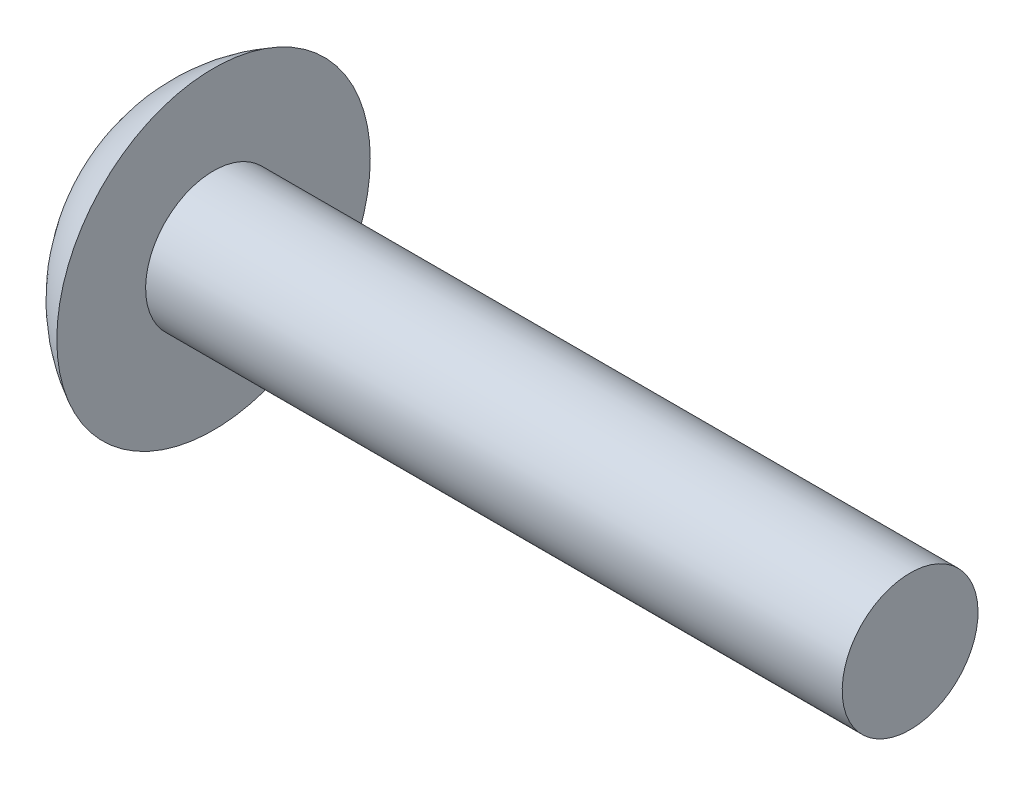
ISO-10303-21;
HEADER;
FILE_DESCRIPTION(('STEP AP214'),'2;1');
FILE_NAME('part.step','',(''),(''),'','','');
FILE_SCHEMA(('AUTOMOTIVE_DESIGN { 1 0 10303 214 1 1 1 1 }'));
ENDSEC;
DATA;
#1=APPLICATION_CONTEXT('core data for automotive mechanical design processes');
#2=APPLICATION_PROTOCOL_DEFINITION('international standard','automotive_design',2000,#1);
#3=PRODUCT_CONTEXT('',#1,'mechanical');
#4=PRODUCT('Part','Part','',(#3));
#5=PRODUCT_RELATED_PRODUCT_CATEGORY('part','',(#4));
#6=PRODUCT_DEFINITION_FORMATION('','',#4);
#7=PRODUCT_DEFINITION_CONTEXT('part definition',#1,'design');
#8=PRODUCT_DEFINITION('design','',#6,#7);
#9=PRODUCT_DEFINITION_SHAPE('','',#8);
#10=(LENGTH_UNIT() NAMED_UNIT(*) SI_UNIT(.MILLI.,.METRE.));
#11=(NAMED_UNIT(*) PLANE_ANGLE_UNIT() SI_UNIT($,.RADIAN.));
#12=(NAMED_UNIT(*) SI_UNIT($,.STERADIAN.) SOLID_ANGLE_UNIT());
#13=UNCERTAINTY_MEASURE_WITH_UNIT(LENGTH_MEASURE(1.E-05),#10,'distance_accuracy_value','');
#14=(GEOMETRIC_REPRESENTATION_CONTEXT(3) GLOBAL_UNCERTAINTY_ASSIGNED_CONTEXT((#13)) GLOBAL_UNIT_ASSIGNED_CONTEXT((#10,
#11,#12)) REPRESENTATION_CONTEXT('',''));
#15=CARTESIAN_POINT('',(0.,0.,0.));
#16=DIRECTION('',(0.,0.,1.));
#17=DIRECTION('',(1.,0.,0.));
#18=AXIS2_PLACEMENT_3D('',#15,#16,#17);
#19=CARTESIAN_POINT('',(7.,-2.5,2.97496745));
#20=DIRECTION('',(1.,0.,0.));
#21=DIRECTION('',(0.,0.,-1.));
#22=AXIS2_PLACEMENT_3D('',#19,#20,#21);
#23=PLANE('',#22);
#24=DIRECTION('',(0.,0.,1.));
#25=VECTOR('',#24,1.);
#26=CARTESIAN_POINT('',(7.,2.5,-0.0991115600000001));
#27=LINE('',#26,#25);
#28=CARTESIAN_POINT('',(7.,2.5,-1.545084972));
#29=VERTEX_POINT('',#28);
#30=CARTESIAN_POINT('',(7.,2.5,1.346861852));
#31=VERTEX_POINT('',#30);
#32=EDGE_CURVE('E128',#29,#31,#27,.T.);
#33=ORIENTED_EDGE('',*,*,#32,.F.);
#34=DIRECTION('',(0.,0.894427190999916,0.447213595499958));
#35=VECTOR('',#34,1.);
#36=CARTESIAN_POINT('',(7.,1.206682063,-2.1917439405));
#37=LINE('',#36,#35);
#38=CARTESIAN_POINT('',(7.,-0.086635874,-2.838402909));
#39=VERTEX_POINT('',#38);
#40=EDGE_CURVE('E112',#39,#29,#37,.T.);
#41=ORIENTED_EDGE('',*,*,#40,.F.);
#42=DIRECTION('',(0.,0.834511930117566,-0.550989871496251));
#43=VECTOR('',#42,1.);
#44=CARTESIAN_POINT('',(7.,-1.293317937,-2.0416862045));
#45=LINE('',#44,#43);
#46=CARTESIAN_POINT('',(7.,-2.5,-1.2449695));
#47=VERTEX_POINT('',#46);
#48=EDGE_CURVE('E110',#47,#39,#45,.T.);
#49=ORIENTED_EDGE('',*,*,#48,.F.);
#50=DIRECTION('',(0.,0.,-1.));
#51=VECTOR('',#50,1.);
#52=CARTESIAN_POINT('',(7.,-2.5,0.201003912));
#53=LINE('',#52,#51);
#54=CARTESIAN_POINT('',(7.,-2.5,1.646977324));
#55=VERTEX_POINT('',#54);
#56=EDGE_CURVE('E89',#55,#47,#53,.T.);
#57=ORIENTED_EDGE('',*,*,#56,.F.);
#58=DIRECTION('',(0.,-0.894427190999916,-0.447213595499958));
#59=VECTOR('',#58,1.);
#60=CARTESIAN_POINT('',(7.,-1.206682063,2.2936362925));
#61=LINE('',#60,#59);
#62=CARTESIAN_POINT('',(7.,0.086635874,2.940295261));
#63=VERTEX_POINT('',#62);
#64=EDGE_CURVE('E136',#63,#55,#61,.T.);
#65=ORIENTED_EDGE('',*,*,#64,.F.);
#66=DIRECTION('',(0.,-0.834511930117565,0.550989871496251));
#67=VECTOR('',#66,1.);
#68=CARTESIAN_POINT('',(7.,1.293317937,2.1435785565));
#69=LINE('',#68,#67);
#70=EDGE_CURVE('E95',#31,#63,#69,.T.);
#71=ORIENTED_EDGE('',*,*,#70,.F.);
#72=EDGE_LOOP('',(#33,#41,#49,#57,#65,#71));
#73=FACE_BOUND('',#72,.T.);
#74=ADVANCED_FACE('F32',(#73),#23,.F.);
#75=CARTESIAN_POINT('',(4.112358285,-2.5,-1.2449695));
#76=DIRECTION('',(0.,1.,0.));
#77=DIRECTION('',(0.,0.,1.));
#78=AXIS2_PLACEMENT_3D('',#75,#76,#77);
#79=PLANE('',#78);
#80=ORIENTED_EDGE('',*,*,#56,.T.);
#81=DIRECTION('',(1.,0.,0.));
#82=VECTOR('',#81,1.);
#83=CARTESIAN_POINT('',(5.5357153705,-2.5,-1.2449695));
#84=LINE('',#83,#82);
#85=CARTESIAN_POINT('',(4.19727614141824,-2.50000000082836,-1.24496949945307));
#86=VERTEX_POINT('',#85);
#87=EDGE_CURVE('E76',#86,#47,#84,.T.);
#88=ORIENTED_EDGE('',*,*,#87,.F.);
#89=CARTESIAN_POINT('',(4.24496865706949,-2.49999999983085,1.64697732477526));
#90=CARTESIAN_POINT('',(4.2285302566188,-2.49999999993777,1.52708590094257));
#91=CARTESIAN_POINT('',(4.21408470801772,-2.49999999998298,1.4069370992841));
#92=CARTESIAN_POINT('',(4.18899502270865,-2.50000000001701,1.1662575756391));
#93=CARTESIAN_POINT('',(4.1783504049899,-2.50000000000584,1.0457269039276));
#94=CARTESIAN_POINT('',(4.15189573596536,-2.49999999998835,0.684529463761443));
#95=CARTESIAN_POINT('',(4.14145661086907,-2.49999999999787,0.443447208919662));
#96=CARTESIAN_POINT('',(4.13583660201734,-2.50000000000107,0.0817374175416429));
#97=CARTESIAN_POINT('',(4.13563632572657,-2.50000000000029,-0.0388455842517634));
#98=CARTESIAN_POINT('',(4.13859022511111,-2.49999999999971,-0.279971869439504));
#99=CARTESIAN_POINT('',(4.14174426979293,-2.49999999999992,-0.400515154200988));
#100=CARTESIAN_POINT('',(4.15150020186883,-2.50000000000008,-0.641862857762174));
#101=CARTESIAN_POINT('',(4.15811348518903,-2.50000000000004,-0.762666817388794));
#102=CARTESIAN_POINT('',(4.17494919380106,-2.49999999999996,-1.00403134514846));
#103=CARTESIAN_POINT('',(4.1851718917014,-2.49999999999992,-1.12459189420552));
#104=CARTESIAN_POINT('',(4.19727614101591,-2.5,-1.24496949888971));
#105=B_SPLINE_CURVE_WITH_KNOTS('',3,(#89,#90,#91,#92,#93,#94,#95,#96,#97,#98,#99,#100,#101,#102,
#103,#104),.UNSPECIFIED.,.F.,.F.,(4,2,2,2,2,2,2,4),(0.,0.362994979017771,0.725944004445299,
1.44939425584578,1.8111114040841,2.1728144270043,2.53571659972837,2.89864618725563),.UNSPECIFIED.);
#106=CARTESIAN_POINT('',(4.24496865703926,-2.5,1.64697732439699));
#107=VERTEX_POINT('',#106);
#108=EDGE_CURVE('E36',#107,#86,#105,.T.);
#109=ORIENTED_EDGE('',*,*,#108,.F.);
#110=DIRECTION('',(-1.,0.,0.));
#111=VECTOR('',#110,1.);
#112=CARTESIAN_POINT('',(5.5528071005,-2.5,1.646977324));
#113=LINE('',#112,#111);
#114=EDGE_CURVE('E106',#55,#107,#113,.T.);
#115=ORIENTED_EDGE('',*,*,#114,.F.);
#116=EDGE_LOOP('',(#80,#88,#109,#115));
#117=FACE_BOUND('',#116,.T.);
#118=ADVANCED_FACE('F105',(#117),#79,.T.);
#119=CARTESIAN_POINT('',(4.071430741,-0.086635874,-2.838402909));
#120=DIRECTION('',(0.,0.550989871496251,0.834511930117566));
#121=DIRECTION('',(0.,-0.834511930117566,0.550989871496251));
#122=AXIS2_PLACEMENT_3D('',#119,#120,#121);
#123=PLANE('',#122);
#124=ORIENTED_EDGE('',*,*,#48,.T.);
#125=DIRECTION('',(1.,0.,0.));
#126=VECTOR('',#125,1.);
#127=CARTESIAN_POINT('',(5.543372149,-0.086635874,-2.838402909));
#128=LINE('',#127,#126);
#129=CARTESIAN_POINT('',(4.20798416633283,-0.086635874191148,-2.83840290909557));
#130=VERTEX_POINT('',#129);
#131=EDGE_CURVE('E116',#130,#39,#128,.T.);
#132=ORIENTED_EDGE('',*,*,#131,.F.);
#133=CARTESIAN_POINT('',(4.19727614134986,-2.50000000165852,-1.24496949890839));
#134=CARTESIAN_POINT('',(4.18367863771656,-2.3996942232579,-1.31119679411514));
#135=CARTESIAN_POINT('',(4.17199728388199,-2.29921296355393,-1.3775399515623));
#136=CARTESIAN_POINT('',(4.15228760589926,-2.09801109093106,-1.51038430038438));
#137=CARTESIAN_POINT('',(4.14425889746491,-1.99729050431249,-1.57688547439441));
#138=CARTESIAN_POINT('',(4.13169255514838,-1.79602237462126,-1.70977356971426));
#139=CARTESIAN_POINT('',(4.12714385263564,-1.69547530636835,-1.77616017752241));
#140=CARTESIAN_POINT('',(4.12137029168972,-1.49431044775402,-1.90898008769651));
#141=CARTESIAN_POINT('',(4.12014559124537,-1.39369265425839,-1.97541339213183));
#142=CARTESIAN_POINT('',(4.12098261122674,-1.19246278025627,-2.10827622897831));
#143=CARTESIAN_POINT('',(4.12304445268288,-1.09185070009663,-2.17470576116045));
#144=CARTESIAN_POINT('',(4.1305171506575,-0.890717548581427,-2.30750473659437));
#145=CARTESIAN_POINT('',(4.13592783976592,-0.790196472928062,-2.37387418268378));
#146=CARTESIAN_POINT('',(4.1502632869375,-0.589003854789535,-2.50671242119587));
#147=CARTESIAN_POINT('',(4.15919924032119,-0.488332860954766,-2.57318085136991));
#148=CARTESIAN_POINT('',(4.18077060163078,-0.287256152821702,-2.70594255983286));
#149=CARTESIAN_POINT('',(4.19340644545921,-0.186850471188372,-2.77223581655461));
#150=CARTESIAN_POINT('',(4.20798416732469,-0.0866358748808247,-2.83840290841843));
#151=B_SPLINE_CURVE_WITH_KNOTS('',3,(#133,#134,#135,#136,#137,#138,#139,#140,#141,#142,#143,
#144,#145,#146,#147,#148,#149,#150),.UNSPECIFIED.,.F.,.F.,(4,2,2,2,2,2,2,2,4),(0.,
0.362866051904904,0.725693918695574,1.08736290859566,1.44904908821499,1.81074858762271,
2.17243000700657,2.53526939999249,2.89815155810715),.UNSPECIFIED.);
#152=EDGE_CURVE('E120',#86,#130,#151,.T.);
#153=ORIENTED_EDGE('',*,*,#152,.F.);
#154=ORIENTED_EDGE('',*,*,#87,.T.);
#155=EDGE_LOOP('',(#124,#132,#153,#154));
#156=FACE_BOUND('',#155,.T.);
#157=ADVANCED_FACE('F118',(#156),#123,.T.);
#158=CARTESIAN_POINT('',(4.086744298,2.5,-1.545084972));
#159=DIRECTION('',(0.,-0.447213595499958,0.894427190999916));
#160=DIRECTION('',(0.,-0.894427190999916,-0.447213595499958));
#161=AXIS2_PLACEMENT_3D('',#158,#159,#160);
#162=PLANE('',#161);
#163=ORIENTED_EDGE('',*,*,#40,.T.);
#164=DIRECTION('',(1.,0.,0.));
#165=VECTOR('',#164,1.);
#166=CARTESIAN_POINT('',(5.557624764,2.5,-1.545084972));
#167=LINE('',#166,#165);
#168=CARTESIAN_POINT('',(4.23148560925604,2.5,-1.54508497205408));
#169=VERTEX_POINT('',#168);
#170=EDGE_CURVE('E125',#169,#29,#167,.T.);
#171=ORIENTED_EDGE('',*,*,#170,.F.);
#172=CARTESIAN_POINT('',(4.20798416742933,-0.0866358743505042,-2.83840290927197));
#173=CARTESIAN_POINT('',(4.20444673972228,-0.0577710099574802,-2.82397047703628));
#174=CARTESIAN_POINT('',(4.20104698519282,-0.0288919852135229,-2.80953096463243));
#175=CARTESIAN_POINT('',(4.17440351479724,0.206969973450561,-2.69159998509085));
#176=CARTESIAN_POINT('',(4.15800561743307,0.414605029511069,-2.58778245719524));
#177=CARTESIAN_POINT('',(4.13797893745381,0.830412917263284,-2.3798785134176));
#178=CARTESIAN_POINT('',(4.13435568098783,1.03858594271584,-2.27579200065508));
#179=CARTESIAN_POINT('',(4.13952574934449,1.45623030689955,-2.06696981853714));
#180=CARTESIAN_POINT('',(4.14840247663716,1.66570099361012,-1.96223447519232));
#181=CARTESIAN_POINT('',(4.1717753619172,1.9792296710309,-1.80547013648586));
#182=CARTESIAN_POINT('',(4.18123901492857,2.0836004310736,-1.75328475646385));
#183=CARTESIAN_POINT('',(4.20368314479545,2.29204733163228,-1.64906130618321));
#184=CARTESIAN_POINT('',(4.21666392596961,2.39612344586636,-1.59702324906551));
#185=CARTESIAN_POINT('',(4.23148560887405,2.49999999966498,-1.54508497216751));
#186=B_SPLINE_CURVE_WITH_KNOTS('',3,(#172,#173,#174,#175,#176,#177,#178,#179,#180,#181,#182,
#183,#184,#185),.UNSPECIFIED.,.F.,.F.,(4,2,2,2,2,2,4),(0.,0.0973975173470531,0.795112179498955,
1.49312862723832,2.19582451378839,2.54699759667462,2.89820107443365),.UNSPECIFIED.);
#187=EDGE_CURVE('E197',#130,#169,#186,.T.);
#188=ORIENTED_EDGE('',*,*,#187,.F.);
#189=ORIENTED_EDGE('',*,*,#131,.T.);
#190=EDGE_LOOP('',(#163,#171,#188,#189));
#191=FACE_BOUND('',#190,.T.);
#192=ADVANCED_FACE('F205',(#191),#162,.T.);
#193=CARTESIAN_POINT('',(4.115249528,2.5,1.346861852));
#194=DIRECTION('',(0.,-1.,0.));
#195=DIRECTION('',(0.,0.,-1.));
#196=AXIS2_PLACEMENT_3D('',#193,#194,#195);
#197=PLANE('',#196);
#198=ORIENTED_EDGE('',*,*,#32,.T.);
#199=DIRECTION('',(1.,0.,0.));
#200=VECTOR('',#199,1.);
#201=CARTESIAN_POINT('',(5.5428843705,2.5,1.346861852));
#202=LINE('',#201,#200);
#203=CARTESIAN_POINT('',(4.20798416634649,2.50000000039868,1.34686185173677));
#204=VERTEX_POINT('',#203);
#205=EDGE_CURVE('E131',#204,#31,#202,.T.);
#206=ORIENTED_EDGE('',*,*,#205,.F.);
#207=CARTESIAN_POINT('',(4.23148560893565,2.5,-1.54508497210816));
#208=CARTESIAN_POINT('',(4.21616741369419,2.5,-1.42506555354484));
#209=CARTESIAN_POINT('',(4.20281706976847,2.5,-1.30481070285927));
#210=CARTESIAN_POINT('',(4.17986746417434,2.5,-1.06395665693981));
#211=CARTESIAN_POINT('',(4.17026776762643,2.5,-0.943357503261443));
#212=CARTESIAN_POINT('',(4.14686567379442,2.5,-0.582002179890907));
#213=CARTESIAN_POINT('',(4.13835999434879,2.5,-0.34088072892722));
#214=CARTESIAN_POINT('',(4.13559864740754,2.5,0.0208197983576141));
#215=CARTESIAN_POINT('',(4.13634453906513,2.5,0.141392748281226));
#216=CARTESIAN_POINT('',(4.14120580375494,2.5,0.382471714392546));
#217=CARTESIAN_POINT('',(4.14532103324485,2.5,0.502977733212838));
#218=CARTESIAN_POINT('',(4.15703876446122,2.5,0.744219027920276));
#219=CARTESIAN_POINT('',(4.16465271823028,2.5,0.864953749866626));
#220=CARTESIAN_POINT('',(4.183535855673,2.5,1.10614714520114));
#221=CARTESIAN_POINT('',(4.194805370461,2.5,1.22660579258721));
#222=CARTESIAN_POINT('',(4.20798416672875,2.5,1.34686185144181));
#223=B_SPLINE_CURVE_WITH_KNOTS('',3,(#207,#208,#209,#210,#211,#212,#213,#214,#215,#216,#217,
#218,#219,#220,#221,#222),.UNSPECIFIED.,.F.,.F.,(4,2,2,2,2,2,2,4),(0.,0.362935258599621,
0.725828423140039,1.4491777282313,1.81087067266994,2.17254820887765,2.5354181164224,
2.89832090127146),.UNSPECIFIED.);
#224=EDGE_CURVE('E215',#169,#204,#223,.T.);
#225=ORIENTED_EDGE('',*,*,#224,.F.);
#226=ORIENTED_EDGE('',*,*,#170,.T.);
#227=EDGE_LOOP('',(#198,#206,#225,#226));
#228=FACE_BOUND('',#227,.T.);
#229=ADVANCED_FACE('F210',(#228),#197,.T.);
#230=CARTESIAN_POINT('',(4.085768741,0.086635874,2.940295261));
#231=DIRECTION('',(0.,-0.550989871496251,-0.834511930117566));
#232=DIRECTION('',(0.,0.834511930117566,-0.550989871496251));
#233=AXIS2_PLACEMENT_3D('',#230,#231,#232);
#234=PLANE('',#233);
#235=ORIENTED_EDGE('',*,*,#70,.T.);
#236=DIRECTION('',(1.,0.,0.));
#237=VECTOR('',#236,1.);
#238=CARTESIAN_POINT('',(5.5528071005,0.086635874,2.940295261));
#239=LINE('',#238,#237);
#240=CARTESIAN_POINT('',(4.23212802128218,0.0866358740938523,2.94029526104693));
#241=VERTEX_POINT('',#240);
#242=EDGE_CURVE('E57',#241,#63,#239,.T.);
#243=ORIENTED_EDGE('',*,*,#242,.F.);
#244=CARTESIAN_POINT('',(4.207984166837,2.50000000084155,1.34686185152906));
#245=CARTESIAN_POINT('',(4.19483139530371,2.39964225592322,1.41312345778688));
#246=CARTESIAN_POINT('',(4.18358732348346,2.29911583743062,1.47949643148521));
#247=CARTESIAN_POINT('',(4.16475434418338,2.09783323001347,1.61239408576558));
#248=CARTESIAN_POINT('',(4.15716510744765,1.99707706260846,1.67891875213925));
#249=CARTESIAN_POINT('',(4.14549646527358,1.795755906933,1.81184185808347));
#250=CARTESIAN_POINT('',(4.1414056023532,1.69519137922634,1.87823999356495));
#251=CARTESIAN_POINT('',(4.13659348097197,1.49400705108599,2.01107275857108));
#252=CARTESIAN_POINT('',(4.13587236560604,1.39338724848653,2.07750738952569));
#253=CARTESIAN_POINT('',(4.13870985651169,1.09154361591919,2.27680086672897));
#254=CARTESIAN_POINT('',(4.14726874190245,0.890325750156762,2.40965577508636));
#255=CARTESIAN_POINT('',(4.17075643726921,0.588773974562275,2.6087565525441));
#256=CARTESIAN_POINT('',(4.18038570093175,0.488134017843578,2.67520449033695));
#257=CARTESIAN_POINT('',(4.2033961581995,0.287142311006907,2.80791007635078));
#258=CARTESIAN_POINT('',(4.21677778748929,0.186790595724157,2.87416770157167));
#259=CARTESIAN_POINT('',(4.23212802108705,0.0866358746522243,2.94029526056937));
#260=B_SPLINE_CURVE_WITH_KNOTS('',3,(#244,#245,#246,#247,#248,#249,#250,#251,#252,#253,#254,
#255,#256,#257,#258,#259),.UNSPECIFIED.,.F.,.F.,(4,2,2,2,2,2,2,4),(0.,0.362903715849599,
0.725774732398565,1.08745271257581,1.44914605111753,2.17249746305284,2.53539233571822,
2.89832936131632),.UNSPECIFIED.);
#261=EDGE_CURVE('E173',#204,#241,#260,.T.);
#262=ORIENTED_EDGE('',*,*,#261,.F.);
#263=ORIENTED_EDGE('',*,*,#205,.T.);
#264=EDGE_LOOP('',(#235,#243,#262,#263));
#265=FACE_BOUND('',#264,.T.);
#266=ADVANCED_FACE('F185',(#265),#234,.T.);
#267=CARTESIAN_POINT('',(4.105614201,-2.5,1.646977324));
#268=DIRECTION('',(0.,0.447213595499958,-0.894427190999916));
#269=DIRECTION('',(0.,0.894427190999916,0.447213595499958));
#270=AXIS2_PLACEMENT_3D('',#267,#268,#269);
#271=PLANE('',#270);
#272=ORIENTED_EDGE('',*,*,#64,.T.);
#273=ORIENTED_EDGE('',*,*,#114,.T.);
#274=CARTESIAN_POINT('',(4.23212802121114,0.0866358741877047,2.94029526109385));
#275=CARTESIAN_POINT('',(4.22841564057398,0.0577718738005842,2.92586326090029));
#276=CARTESIAN_POINT('',(4.2248425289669,0.0288928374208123,2.91142374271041));
#277=CARTESIAN_POINT('',(4.19681400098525,-0.206839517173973,2.79355756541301));
#278=CARTESIAN_POINT('',(4.17928087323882,-0.414386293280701,2.68978417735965));
#279=CARTESIAN_POINT('',(4.15722197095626,-0.830081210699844,2.48193671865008));
#280=CARTESIAN_POINT('',(4.15270205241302,-1.03822958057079,2.3778625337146));
#281=CARTESIAN_POINT('',(4.15627827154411,-1.45589898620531,2.16902783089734));
#282=CARTESIAN_POINT('',(4.16446159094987,-1.66541959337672,2.06426752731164));
#283=CARTESIAN_POINT('',(4.18684850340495,-1.97904092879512,1.90745685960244));
#284=CARTESIAN_POINT('',(4.19599240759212,-2.08344415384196,1.85525524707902));
#285=CARTESIAN_POINT('',(4.21780142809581,-2.29196314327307,1.75099575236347));
#286=CARTESIAN_POINT('',(4.23046680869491,-2.39607888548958,1.69893788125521));
#287=CARTESIAN_POINT('',(4.24496865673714,-2.4999999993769,1.64697732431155));
#288=B_SPLINE_CURVE_WITH_KNOTS('',3,(#274,#275,#276,#277,#278,#279,#280,#281,#282,#283,#284,
#285,#286,#287),.UNSPECIFIED.,.F.,.F.,(4,2,2,2,2,2,4),(0.,0.097453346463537,0.795107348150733,
1.49307524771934,2.19585448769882,2.54705996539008,2.89829180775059),.UNSPECIFIED.);
#289=EDGE_CURVE('E82',#241,#107,#288,.T.);
#290=ORIENTED_EDGE('',*,*,#289,.F.);
#291=ORIENTED_EDGE('',*,*,#242,.T.);
#292=EDGE_LOOP('',(#272,#273,#290,#291));
#293=FACE_BOUND('',#292,.T.);
#294=ADVANCED_FACE('F182',(#293),#271,.T.);
#295=CARTESIAN_POINT('',(13.2499999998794,0.,0.));
#296=DIRECTION('',(-1.,0.,0.));
#297=DIRECTION('',(0.,0.,1.));
#298=AXIS2_PLACEMENT_3D('',#295,#296,#297);
#299=DEGENERATE_TOROIDAL_SURFACE('',#298,0.749999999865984,9.28035559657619,.T.);
#300=ORIENTED_EDGE('',*,*,#152,.T.);
#301=ORIENTED_EDGE('',*,*,#187,.T.);
#302=ORIENTED_EDGE('',*,*,#224,.T.);
#303=ORIENTED_EDGE('',*,*,#261,.T.);
#304=ORIENTED_EDGE('',*,*,#289,.T.);
#305=ORIENTED_EDGE('',*,*,#108,.T.);
#306=EDGE_LOOP('',(#300,#301,#302,#303,#304,#305));
#307=FACE_BOUND('',#306,.T.);
#308=CARTESIAN_POINT('',(8.99999999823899,0.,0.));
#309=DIRECTION('',(-1.,0.,0.));
#310=DIRECTION('',(0.,0.,1.));
#311=AXIS2_PLACEMENT_3D('',#308,#309,#310);
#312=CIRCLE('',#311,8.99999999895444);
#313=CARTESIAN_POINT('',(8.99999999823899,0.,8.99999999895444));
#314=VERTEX_POINT('',#313);
#315=EDGE_CURVE('E163',#314,#314,#312,.T.);
#316=ORIENTED_EDGE('',*,*,#315,.T.);
#317=EDGE_LOOP('',(#316));
#318=FACE_BOUND('',#317,.T.);
#319=ADVANCED_FACE('F180',(#307,#318),#299,.T.);
#320=CARTESIAN_POINT('',(49.,-3.960380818,-3.9468));
#321=DIRECTION('',(-1.,0.,0.));
#322=DIRECTION('',(0.,0.,1.));
#323=AXIS2_PLACEMENT_3D('',#320,#321,#322);
#324=PLANE('',#323);
#325=CARTESIAN_POINT('',(49.,0.,0.));
#326=DIRECTION('',(-1.,0.,0.));
#327=DIRECTION('',(0.,-1.,0.));
#328=AXIS2_PLACEMENT_3D('',#325,#326,#327);
#329=CIRCLE('',#328,3.9);
#330=CARTESIAN_POINT('',(49.,-3.9,0.));
#331=VERTEX_POINT('',#330);
#332=EDGE_CURVE('E48',#331,#331,#329,.T.);
#333=ORIENTED_EDGE('',*,*,#332,.F.);
#334=EDGE_LOOP('',(#333));
#335=FACE_BOUND('',#334,.T.);
#336=ADVANCED_FACE('F234',(#335),#324,.F.);
#337=CARTESIAN_POINT('',(9.,-9.139340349,-9.108));
#338=DIRECTION('',(-1.,0.,0.));
#339=DIRECTION('',(0.,0.,1.));
#340=AXIS2_PLACEMENT_3D('',#337,#338,#339);
#341=PLANE('',#340);
#342=CARTESIAN_POINT('',(9.,0.,0.));
#343=DIRECTION('',(-1.,0.,0.));
#344=DIRECTION('',(0.,-1.,0.));
#345=AXIS2_PLACEMENT_3D('',#342,#343,#344);
#346=CIRCLE('',#345,3.9);
#347=CARTESIAN_POINT('',(9.00000000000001,-3.90000000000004,0.));
#348=VERTEX_POINT('',#347);
#349=EDGE_CURVE('E11',#348,#348,#346,.F.);
#350=ORIENTED_EDGE('',*,*,#349,.F.);
#351=EDGE_LOOP('',(#350));
#352=FACE_BOUND('',#351,.T.);
#353=ORIENTED_EDGE('',*,*,#315,.F.);
#354=EDGE_LOOP('',(#353));
#355=FACE_BOUND('',#354,.T.);
#356=ADVANCED_FACE('F34',(#352,#355),#341,.F.);
#357=CARTESIAN_POINT('',(49.,0.,0.));
#358=DIRECTION('',(-1.,0.,0.));
#359=DIRECTION('',(0.,-1.,0.));
#360=AXIS2_PLACEMENT_3D('',#357,#358,#359);
#361=CYLINDRICAL_SURFACE('',#360,3.9);
#362=ORIENTED_EDGE('',*,*,#349,.T.);
#363=EDGE_LOOP('',(#362));
#364=FACE_BOUND('',#363,.T.);
#365=ORIENTED_EDGE('',*,*,#332,.T.);
#366=EDGE_LOOP('',(#365));
#367=FACE_BOUND('',#366,.T.);
#368=ADVANCED_FACE('F227',(#364,#367),#361,.T.);
#369=CLOSED_SHELL('',(#74,#118,#157,#192,#229,#266,#294,#319,#336,#356,#368));
#370=MANIFOLD_SOLID_BREP('B2',#369);
#371=ADVANCED_BREP_SHAPE_REPRESENTATION('',(#18,#370),#14);
#372=SHAPE_DEFINITION_REPRESENTATION(#9,#371);
ENDSEC;
END-ISO-10303-21;
